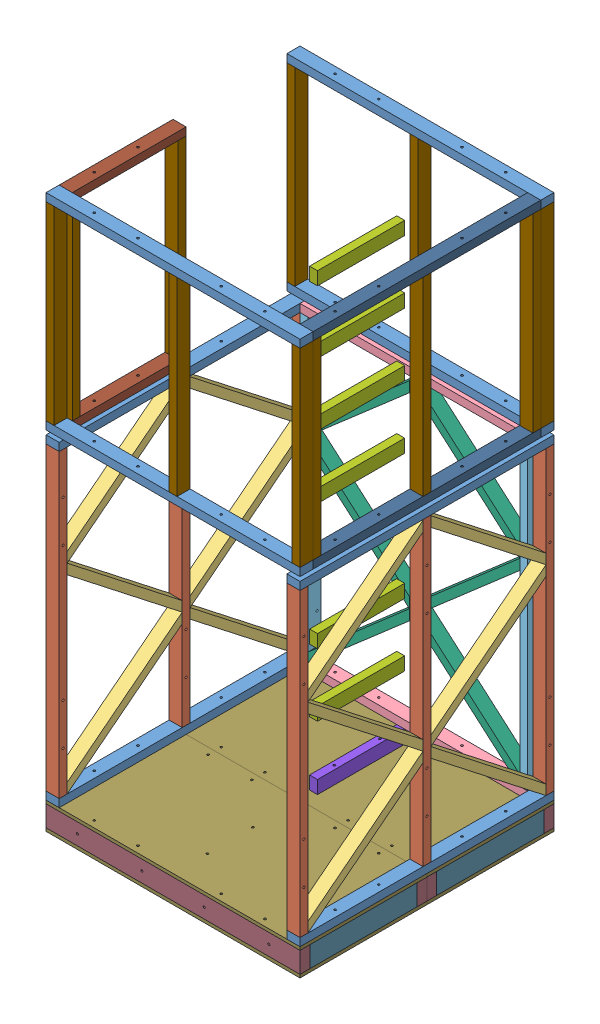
SolidWorks assembly Tower V3.SLDASM, configuration Default (file format 15000). Lengths in mm.
Overall size (1221.92 2833 1223.62).
98 component instances, 19 part files, 40 mates.
Components (placement in the parent):
- AA Top Floor-1: AA Top Floor.SLDPRT [Default] at (0 1825 1220) size (1220 20 1220)
- Wheel-1: Wheel.SLDPRT [Default] at (134.6117 75 1111.9531) x (0.998009 0 -0.063073) z (0.063073 0 0.998009) size (200 175 50)
- Wheel-2: Wheel.SLDPRT [Default] at (1110.2769 75 519.3338) x (0.982082 0 -0.188455) z (0.188455 0 0.982082) size (200 175 50)
- Wheel-3: Wheel.SLDPRT [Default] at (1109.917 75 671.7975) x (0.918365 0 -0.395734) z (0.395734 0 0.918365) size (200 175 50)
- Wheel-4: Wheel.SLDPRT [Default] at (1117.921 75 1131.6237) x (0.8 0 -0.6) z (0.6 0 0.8) size (200 175 50)
- Wheel-5: Wheel.SLDPRT [Default] at (1102.9895 75 93.9579) x (0.63358 0 -0.773678) z (0.773678 0 0.63358) size (200 175 50)
- Wheel-6: Wheel.SLDPRT [Default] at (86.5557 75 758.1732) x (0.443629 0 -0.896211) z (0.896211 0 0.443629) size (200 175 50)
- Wheel-7: Wheel.SLDPRT [Default] at (51.9209 75 101.9393) x (0.263225 0 -0.964735) z (0.964735 0 0.263225) size (200 175 50)
- Wheel-9: Wheel.SLDPRT [Default] at (127.8855 75 504.7689) x (0.982082 0 -0.188455) z (0.188455 0 0.982082) size (200 175 50)
- Back Board-1: Back Board.SLDPRT [Default] at (-519.6614 661.6299 502.9688) size (1220 2440 4) (hidden)
- #02 Side Piece-3: #02 Side Piece.SLDASM [Default] at (2273.8793 -194.6588 292.9005) x (0 0 1) z (-1 0 0) size (1220 1520 63)
  - A - 4ft CLS-1: A - 4ft CLS.SLDPRT [Default] at (-292.9005 499.6588 1116.8793) size (1220 38 63)
  - B - 5ft CLS vertical-1: B - 5ft CLS vertical.SLDPRT [Default] at (-292.9005 537.6588 1116.8793) x (0 0 -1) z (1 0 0) size (63 1444 38)
  - A - 4ft CLS-2: A - 4ft CLS.SLDPRT [Default] at (-292.9005 1981.6588 1116.8793) size (1220 38 63)
  - B - 5ft CLS vertical-2: B - 5ft CLS vertical.SLDPRT [Default] at (298.0995 537.6588 1116.8793) x (0 0 -1) z (1 0 0) size (63 1444 38)
  - B - 5ft CLS vertical-3: B - 5ft CLS vertical.SLDPRT [Default] at (889.0995 537.6588 1116.8793) x (0 0 -1) z (1 0 0) size (63 1444 38)
  - C - angled brace-1: C - angled brace.SLDPRT [Default] at (-254.9005 537.6588 1053.8793) size (553 480.27 63)
  - C - angled brace-2: C - angled brace.SLDPRT [Default] at (-254.9005 1498.206 1116.8793) x (1 0 0) z (0 0 -1) size (553 480.27 63)
  - C - angled brace-3: C - angled brace.SLDPRT [Default] at (-254.9005 1498.206 1053.8793) size (553 480.27 63)
  - C - angled brace-5: C - angled brace.SLDPRT [Default] at (889.0995 1498.206 1116.8793) x (-1 0 0) z (0 0 -1) size (553 480.27 63)
  - C - angled brace-6: C - angled brace.SLDPRT [Default] at (889.0995 1498.206 1053.8793) x (-1 0 0) z (0 0 1) size (553 480.27 63)
  - C - angled brace-7: C - angled brace.SLDPRT [Default] at (889.0995 537.6588 1116.8793) x (-1 0 0) z (0 0 -1) size (553 480.27 63)
- #02 Side Piece-4: #02 Side Piece.SLDASM [Default] at (-1053.8793 -194.6588 927.0995) x (0 0 -1) z (1 0 0) size (1220 1520 63)
  - A - 4ft CLS-1: A - 4ft CLS.SLDPRT [Default] at (-292.9005 499.6588 1116.8793) size (1220 38 63)
  - B - 5ft CLS vertical-1: B - 5ft CLS vertical.SLDPRT [Default] at (-292.9005 537.6588 1116.8793) x (0 0 -1) z (1 0 0) size (63 1444 38)
  - A - 4ft CLS-2: A - 4ft CLS.SLDPRT [Default] at (-292.9005 1981.6588 1116.8793) size (1220 38 63)
  - B - 5ft CLS vertical-2: B - 5ft CLS vertical.SLDPRT [Default] at (298.0995 537.6588 1116.8793) x (0 0 -1) z (1 0 0) size (63 1444 38)
  - B - 5ft CLS vertical-3: B - 5ft CLS vertical.SLDPRT [Default] at (889.0995 537.6588 1116.8793) x (0 0 -1) z (1 0 0) size (63 1444 38)
  - C - angled brace-1: C - angled brace.SLDPRT [Default] at (-254.9005 537.6588 1053.8793) size (553 480.27 63)
  - C - angled brace-2: C - angled brace.SLDPRT [Default] at (-254.9005 1498.206 1116.8793) x (1 0 0) z (0 0 -1) size (553 480.27 63)
  - C - angled brace-3: C - angled brace.SLDPRT [Default] at (-254.9005 1498.206 1053.8793) size (553 480.27 63)
  - C - angled brace-5: C - angled brace.SLDPRT [Default] at (889.0995 1498.206 1116.8793) x (-1 0 0) z (0 0 -1) size (553 480.27 63)
  - C - angled brace-6: C - angled brace.SLDPRT [Default] at (889.0995 1498.206 1053.8793) x (-1 0 0) z (0 0 1) size (553 480.27 63)
  - C - angled brace-7: C - angled brace.SLDPRT [Default] at (889.0995 537.6588 1116.8793) x (-1 0 0) z (0 0 -1) size (553 480.27 63)
- #03 Back Piece-2: #03 Back Piece.SLDASM [Default] at (388.5254 -210.5197 -1093.5636) size (1094 1520 63)
  - D - Back CLS Bottom-1: D - Back CLS Bottom.SLDPRT [Default] at (-388.5254 515.5197 1156.5636) size (1094 38 63)
  - B - 5ft CLS vertical-2: B - 5ft CLS vertical.SLDPRT [Default] at (240.4746 553.5197 1093.5636) x (0 0 1) z (-1 0 0) size (63 1444 38)
  - E - 5ft CLS vertical side holes-1: E - 5ft CLS vertical side holes.SLDPRT [Default] at (-287.5254 553.5197 1093.5636) x (0 0 1) z (-1 0 0) size (63 1444 38)
  - E - 5ft CLS vertical side holes-2: E - 5ft CLS vertical side holes.SLDPRT [Default] at (768.4746 553.5197 1093.5636) x (0 0 1) z (-1 0 0) size (63 1444 38)
  - D - Back CLS Bottom-2: D - Back CLS Bottom.SLDPRT [Default] at (-388.5254 1997.5197 1156.5636) size (1094 38 63)
  - F - back angled brace-1: F - back angled brace.SLDPRT [Default] at (-287.5254 553.5197 1093.5636) size (488 474.56 63)
  - F - back angled brace-2: F - back angled brace.SLDPRT [Default] at (-287.5254 1502.6445 1156.5636) x (1 0 0) z (0 0 -1) size (488 474.56 63)
  - F - back angled brace-3: F - back angled brace.SLDPRT [Default] at (-287.5254 1502.6445 1093.5636) size (488 474.56 63)
  - F - back angled brace-5: F - back angled brace.SLDPRT [Default] at (730.4746 1502.6445 1156.5636) x (-1 0 0) z (0 0 -1) size (488 474.56 63)
  - F - back angled brace-6: F - back angled brace.SLDPRT [Default] at (730.4746 1502.6445 1093.5636) x (-1 0 0) z (0 0 1) size (488 474.56 63)
  - F - back angled brace-7: F - back angled brace.SLDPRT [Default] at (730.4746 553.5197 1156.5636) x (-1 0 0) z (0 0 -1) size (488 474.56 63)
- #04 Ladder-2: #04 Ladder.SLDASM [Default] at (-1396.5267 -23.3609 805.7281) x (0 0 -1) z (1 0 0) size (545 2400 38)
  - H - ladder vertical-1: H - ladder vertical.SLDPRT [Default] at (197.7281 328.3609 1987.5267) size (63 2400 38)
  - I - ladder horizontal-1: I - ladder horizontal.SLDPRT [Default] at (260.7281 633.3609 1987.5267) size (419 63 38)
  - I - ladder horizontal-2: I - ladder horizontal.SLDPRT [Default] at (260.7281 935.3609 1987.5267) size (419 63 38)
  - I - ladder horizontal-3: I - ladder horizontal.SLDPRT [Default] at (260.7281 1237.3609 1987.5267) size (419 63 38)
  - I - ladder horizontal-4: I - ladder horizontal.SLDPRT [Default] at (260.7281 1539.3609 1987.5267) size (419 63 38)
  - I - ladder horizontal-5: I - ladder horizontal.SLDPRT [Default] at (260.7281 1841.3609 1987.5267) size (419 63 38)
  - I - ladder horizontal-6: I - ladder horizontal.SLDPRT [Default] at (260.7281 2143.3609 1987.5267) size (419 63 38)
  - I - ladder horizontal-7: I - ladder horizontal.SLDPRT [Default] at (260.7281 2445.3609 1987.5267) size (419 63 38)
  - H - ladder vertical-2: H - ladder vertical.SLDPRT [Default] at (742.7281 328.3609 2025.5267) x (-1 0 0) z (0 0 -1) size (63 2400 38)
  - N - Ladder Base-1: N - Ladder Base.SLDPRT [Default] at (260.7281 328.3609 1987.5267) size (419 63 38)
- #06 Handrail-2: #06 Handrail.SLDASM [Default] at (317.6251 1243.8315 159.0381) size (1220 988 63)
  - A - 4ft CLS-2: A - 4ft CLS.SLDPRT [Default] at (-317.6251 601.1685 1060.9619) size (1220 38 63)
  - G - handrail vertical-2: G - handrail vertical.SLDPRT [Default] at (-317.6251 639.1685 997.9619) size (38 912 63)
  - G - handrail vertical-3: G - handrail vertical.SLDPRT [Default] at (-317.6251 639.1685 997.9619) size (38 912 63)
  - G - handrail vertical-4: G - handrail vertical.SLDPRT [Default] at (273.3749 639.1685 997.9619) size (38 912 63)
  - G - handrail vertical-6: G - handrail vertical.SLDPRT [Default] at (864.3749 639.1685 997.9619) size (38 912 63)
  - A - 4ft CLS-3: A - 4ft CLS.SLDPRT [Default] at (-317.6251 1551.1685 1060.9619) size (1220 38 63)
- #08 Handrail Side Closed-1: #08 Handrail Side Closed.SLDASM [Default] at (207.9885 1298.1087 884.0331) x (0 0 -1) z (1 0 0) size (1094 988 63)
  - J - handrail side bottom-1: J - handrail side bottom.SLDPRT [Default] at (-335.9669 546.8913 1012.0115) size (1094 38 63)
  - G - handrail vertical-1: G - handrail vertical.SLDPRT [Default] at (-272.9669 584.8913 949.0115) size (38 912 63)
  - G - handrail vertical-3: G - handrail vertical.SLDPRT [Default] at (255.0331 584.8913 949.0115) size (38 912 63)
  - G - handrail vertical-4: G - handrail vertical.SLDPRT [Default] at (783.0331 584.8913 949.0115) size (38 912 63)
  - J - handrail side bottom-2: J - handrail side bottom.SLDPRT [Default] at (-335.9669 1496.8913 1012.0115) size (1094 38 63)
- #07 Handrail Side Open-1: #07 Handrail Side Open.SLDASM [Default] at (452.5064 1584.6948 736.5573) x (0 0 1) z (-1 0 0) size (547 988 63)
  - K - handrail open bottom-1: K - handrail open bottom.SLDPRT [Default] at (-736.5573 260.3052 452.5064) size (547 38 63)
  - G - handrail vertical-1: G - handrail vertical.SLDPRT [Default] at (-126.5573 298.3052 389.5064) size (38 912 63)
  - G - handrail vertical-2: G - handrail vertical.SLDPRT [Default] at (382.4427 298.3052 389.5064) size (38 912 63)
  - K - handrail open bottom-2: K - handrail open bottom.SLDPRT [Default] at (-736.5573 1210.3052 452.5064) size (547 38 63)
- #06 Handrail-3: #06 Handrail.SLDASM [Default] at (317.6251 1243.8315 -997.9619) size (1220 988 63)
  - A - 4ft CLS-2: A - 4ft CLS.SLDPRT [Default] at (-317.6251 601.1685 1060.9619) size (1220 38 63)
  - G - handrail vertical-2: G - handrail vertical.SLDPRT [Default] at (-317.6251 639.1685 997.9619) size (38 912 63)
  - G - handrail vertical-3: G - handrail vertical.SLDPRT [Default] at (-317.6251 639.1685 997.9619) size (38 912 63)
  - G - handrail vertical-4: G - handrail vertical.SLDPRT [Default] at (273.3749 639.1685 997.9619) size (38 912 63)
  - G - handrail vertical-6: G - handrail vertical.SLDPRT [Default] at (864.3749 639.1685 997.9619) size (38 912 63)
  - A - 4ft CLS-3: A - 4ft CLS.SLDPRT [Default] at (-317.6251 1551.1685 1060.9619) size (1220 38 63)
- #01 Base 2x4-1: #01 Base 2x4.SLDASM [Default] at (1634.4357 -437.4324 -5.2028) x (0 0 1) z (-1 0 0) size (610 130 1220)
  - BB - 4ft x 2ft-1: BB - 4ft x 2ft.SLDPRT [Default] at (5.2028 612.4324 1634.4357) size (610 15 1220)
  - M - 4ft carcasssing-1: M - 4ft carcasssing.SLDPRT [Default] at (5.2028 627.4324 414.4357) x (0 0 1) z (-1 0 0) size (1220 100 47)
  - M - 4ft carcasssing-2: M - 4ft carcasssing.SLDPRT [Default] at (615.2028 627.4324 1634.4357) x (0 0 -1) z (1 0 0) size (1220 100 47)
  - L - 2ft carcasssing-1: L - 2ft carcasssing.SLDPRT [Default] at (568.2028 627.4324 414.4357) x (-1 0 0) z (0 0 -1) size (516 100 47)
  - L - 2ft carcasssing-3: L - 2ft carcasssing.SLDPRT [Default] at (52.2028 627.4324 1634.4357) size (516 100 47)
  - BB - 4ft x 2ft-2: BB - 4ft x 2ft.SLDPRT [Default] at (5.2028 727.4324 1634.4357) size (610 15 1220)
  - O - 2ft carcassing middle-1: O - 2ft carcassing middle.SLDPRT [Default] at (568.2028 627.4324 1000.9357) x (-1 0 0) z (0 0 -1) size (516 100 47)
- #01 Base 2x4-2: #01 Base 2x4.SLDASM [Default] at (1634.4357 -437.4324 604.7972) x (0 0 1) z (-1 0 0) size (610 130 1220)
  - BB - 4ft x 2ft-1: BB - 4ft x 2ft.SLDPRT [Default] at (5.2028 612.4324 1634.4357) size (610 15 1220)
  - M - 4ft carcasssing-1: M - 4ft carcasssing.SLDPRT [Default] at (5.2028 627.4324 414.4357) x (0 0 1) z (-1 0 0) size (1220 100 47)
  - M - 4ft carcasssing-2: M - 4ft carcasssing.SLDPRT [Default] at (615.2028 627.4324 1634.4357) x (0 0 -1) z (1 0 0) size (1220 100 47)
  - L - 2ft carcasssing-1: L - 2ft carcasssing.SLDPRT [Default] at (568.2028 627.4324 414.4357) x (-1 0 0) z (0 0 -1) size (516 100 47)
  - L - 2ft carcasssing-3: L - 2ft carcasssing.SLDPRT [Default] at (52.2028 627.4324 1634.4357) size (516 100 47)
  - BB - 4ft x 2ft-2: BB - 4ft x 2ft.SLDPRT [Default] at (5.2028 727.4324 1634.4357) size (610 15 1220)
  - O - 2ft carcassing middle-1: O - 2ft carcassing middle.SLDPRT [Default] at (568.2028 627.4324 1000.9357) x (-1 0 0) z (0 0 -1) size (516 100 47)
Mates (geometry in assembly coordinates):
- Coincident45: coincident anti-aligned: plane of AA Top Floor-1 through (0 1825 1220) normal (0 -1 0); plane of #02 Side Piece-3/A - 4ft CLS-2 through (1157 1825 0) normal (0 1 0)
- Coincident49: coincident aligned: plane of AA Top Floor-1 through (0 1845 1220) normal (0 0 1); plane of #02 Side Piece-4/A - 4ft CLS-2 through (63 1825 1220) normal (0 0 1)
- Coincident52: coincident anti-aligned: plane of #02 Side Piece-4/B - 5ft CLS vertical-3 through (63 343 0) normal (1 0 0); plane of Back Piece-2/E - 5ft CLS vertical side holes-1 through (63 343 0) normal (-1 0 0)
- Coincident53: coincident aligned: plane of #02 Side Piece-4/B - 5ft CLS vertical-3 through (63 343 0) normal (0 0 -1); plane of Back Piece-2/D - back 4ft-1 through (0 343 0) normal (0 0 -1)
- Coincident57: coincident anti-aligned: plane of AA Top Floor-1 through (0 1845 1220) normal (0 1 0); plane of #06 Handrail-2/A - 4ft CLS-2 through (0 1845 1220) normal (0 -1 0)
- Coincident58: coincident aligned: plane of #02 Side Piece-4/A - 4ft CLS-2 through (63 1825 1220) normal (0 0 1); plane of #06 Handrail-2/G - handrail vertical-2 through (0 1883 1220) normal (0 0 1)
- Coincident59: coincident aligned: plane of #02 Side Piece-4/B - 5ft CLS vertical-1 through (0 343 1182) normal (-1 0 0); plane of #06 Handrail-2/G - handrail vertical-2 through (0 1883 1220) normal (-1 0 0)
- Coincident60: coincident anti-aligned: plane of Side Piece-3/B - 5ft -2xCLS vertical-1 through (1157 343 38) normal (-1 0 0); plane of Back Piece-2/E - 5ft CLS vertical side holes-2 through (1157 343 0) normal (1 0 0)
- Coincident61: coincident aligned: plane of AA Top Floor-1 through (1220 1845 1220) normal (1 0 0); plane of #02 Side Piece-3/A - 4ft CLS-2 through (1220 1825 0) normal (1 0 0)
- Coincident62: coincident anti-aligned: plane of AA Top Floor-1 through (0 1845 1220) normal (0 1 0); plane of #08 Handrail Side Closed-1/J - handrail side bottom-1 through (1220 1845 1220) normal (0 -1 0)
- Coincident63: coincident anti-aligned: plane of #06 Handrail-2/G - handrail vertical-6 through (1182 1883 1157) normal (0 0 -1); plane of #08 Handrail Side Closed-1/G - handrail vertical-1 through (1220 1883 1157) normal (0 0 1)
- Coincident64: coincident aligned: plane of #06 Handrail-2/G - handrail vertical-6 through (1220 1883 1220) normal (1 0 0); plane of #08 Handrail Side Closed-1/G - handrail vertical-1 through (1220 1883 1157) normal (1 0 0)
- Coincident65: coincident anti-aligned: plane of AA Top Floor-1 through (0 1845 1220) normal (0 1 0); plane of #07 Handrail Side Open-1/K - handrail open bottom-1 through (0 1845 0) normal (0 -1 0)
- Coincident70: coincident anti-aligned: plane of #06 Handrail-2/A - 4ft CLS-2 through (0 1883 1157) normal (0 0 -1); plane of #07 Handrail Side Open-1/G - handrail vertical-2 through (0 1883 1157) normal (0 0 1)
- Coincident71: coincident aligned: plane of #02 Side Piece-4/A - 4ft CLS-2 through (0 1825 1220) normal (-1 0 0); plane of #07 Handrail Side Open-1/K - handrail open bottom-1 through (0 1883 0) normal (-1 0 0)
- Coincident75: coincident anti-aligned: plane of AA Top Floor-1 through (0 1845 1220) normal (0 1 0); plane of #06 Handrail-3/A - 4ft CLS-2 through (0 1845 63) normal (0 -1 0)
- Coincident76: coincident aligned: plane of #08 Handrail Side Closed-1/G - handrail vertical-4 through (1220 1883 101) normal (1 0 0); plane of #06 Handrail-3/G - handrail vertical-6 through (1220 1883 63) normal (1 0 0)
- Coincident77: coincident anti-aligned: plane of #08 Handrail Side Closed-1/G - handrail vertical-4 through (1220 1883 63) normal (0 0 -1); plane of #06 Handrail-3/G - handrail vertical-6 through (1182 1883 63) normal (0 0 1)
- Coincident78: coincident anti-aligned: plane of #02 Side Piece-4/A - 4ft CLS-1 through (63 305 1220) normal (0 -1 0); plane of #01 Base 2x4-1/BB - 4ft x 2ft-2 through (0 305 0) normal (0 1 0)
- Coincident81: coincident aligned: plane of #02 Side Piece-4/A - 4ft CLS-1 through (0 343 1220) normal (-1 0 0); plane of #01 Base 2x4-1/L - 2ft carcasssing-3 through (0 290 47) normal (-1 0 0)
- Coincident82: coincident aligned: plane of Back Piece-2/D - back 4ft-1 through (0 343 0) normal (0 0 -1); plane of Base 2x4-1/M - 4ft carcasssing-1 through (1220 290 0) normal (0 0 -1)
- Coincident83: coincident anti-aligned: plane of #02 Side Piece-4/A - 4ft CLS-1 through (63 305 1220) normal (0 -1 0); plane of #01 Base 2x4-2/BB - 4ft x 2ft-2 through (0 305 610) normal (0 1 0)
- Coincident84: coincident aligned: plane of #02 Side Piece-4/A - 4ft CLS-1 through (0 343 1220) normal (-1 0 0); plane of #01 Base 2x4-2/L - 2ft carcasssing-3 through (0 290 657) normal (-1 0 0)
- Coincident88: coincident anti-aligned: plane of Back Piece-2/D - back 4ft-1 through (0 305 63) normal (0 -1 0); plane of #01 Base 2x4-1/BB - 4ft x 2ft-2 through (0 305 0) normal (0 1 0)
- Coincident89: coincident anti-aligned: plane of #02 Side Piece-3/A - 4ft CLS-1 through (1157 305 0) normal (0 -1 0); plane of #01 Base 2x4-1/BB - 4ft x 2ft-2 through (0 305 0) normal (0 1 0)
- Coincident91: coincident aligned: plane of Side Piece-3/B - 5ft -2xCLS vertical-1 through (1157 343 0) normal (0 0 -1); plane of Base 2x4-1/M - 4ft carcasssing-1 through (1220 290 0) normal (0 0 -1)
- Coincident92: coincident anti-aligned: plane of #01 Base 2x4-1/L - 2ft carcasssing-3 through (0 290 47) normal (-1 0 0)
- Coincident93: coincident anti-aligned: plane of Base 2x4-1/M - 4ft carcasssing-1 through (1220 290 0) normal (0 0 -1)
- Coincident94: coincident anti-aligned: plane of Wheel-7 through (15.9511 175 195.7805) normal (0 1 0); plane of #01 Base 2x4-1/BB - 4ft x 2ft-1 through (0 175 0) normal (0 -1 0)
- Coincident95: coincident anti-aligned: plane of Wheel-5 through (1031.8948 175 164.9899) normal (0 1 0); plane of #01 Base 2x4-1/BB - 4ft x 2ft-1 through (0 175 0) normal (0 -1 0)
- Coincident96: coincident anti-aligned: plane of Wheel-2 through (1010.1842 175 528.3584) normal (0 1 0); plane of #01 Base 2x4-1/BB - 4ft x 2ft-1 through (0 175 0) normal (0 -1 0)
- Coincident97: coincident anti-aligned: plane of Wheel-3 through (1014.1232 175 702.1873) normal (0 1 0); plane of #01 Base 2x4-1/BB - 4ft x 2ft-1 through (0 175 0) normal (0 -1 0)
- Coincident98: coincident anti-aligned: plane of Wheel-4 through (1061.921 175 1223.6237) normal (0 1 0); plane of #01 Base 2x4-2/BB - 4ft x 2ft-1 through (0 175 610) normal (0 -1 0)
- Coincident99: coincident anti-aligned: plane of Wheel-1 through (37.3337 175 1158.1807) normal (0 1 0); plane of #01 Base 2x4-2/BB - 4ft x 2ft-1 through (0 175 610) normal (0 -1 0)
- Coincident100: coincident anti-aligned: plane of Wheel-6 through (78.0412 175 865.5394) normal (0 1 0); plane of #01 Base 2x4-2/BB - 4ft x 2ft-1 through (0 175 610) normal (0 -1 0)
- Coincident101: coincident anti-aligned: plane of Wheel-9 through (27.7928 175 513.7935) normal (0 1 0); plane of #01 Base 2x4-1/BB - 4ft x 2ft-1 through (0 175 0) normal (0 -1 0)
- Tangent1: tangent anti-aligned: cylinder of Wheel-1 through (136.5038 75 1141.8934) axis (-0.063073 0 -0.998009) radius 75
- Coincident103: coincident anti-aligned: plane of Back Piece-2/B - 5ft -2xCLS vertical-2 through (591 343 63) normal (0 0 1); plane of Ladder-2/H - ladder vertical-2 through (591 305 63) normal (0 0 -1)
- Coincident104: coincident aligned: plane of Back Piece-2/B - 5ft -2xCLS vertical-2 through (591 343 0) normal (-1 0 0); plane of Ladder-2/H - ladder vertical-2 through (591 305 63) normal (-1 0 0)
- Coincident105: coincident anti-aligned: plane of Ladder-2/H - ladder vertical-1 through (629 305 608) normal (0 -1 0); plane of #01 Base 2x4-1/BB - 4ft x 2ft-2 through (0 305 0) normal (0 1 0)
